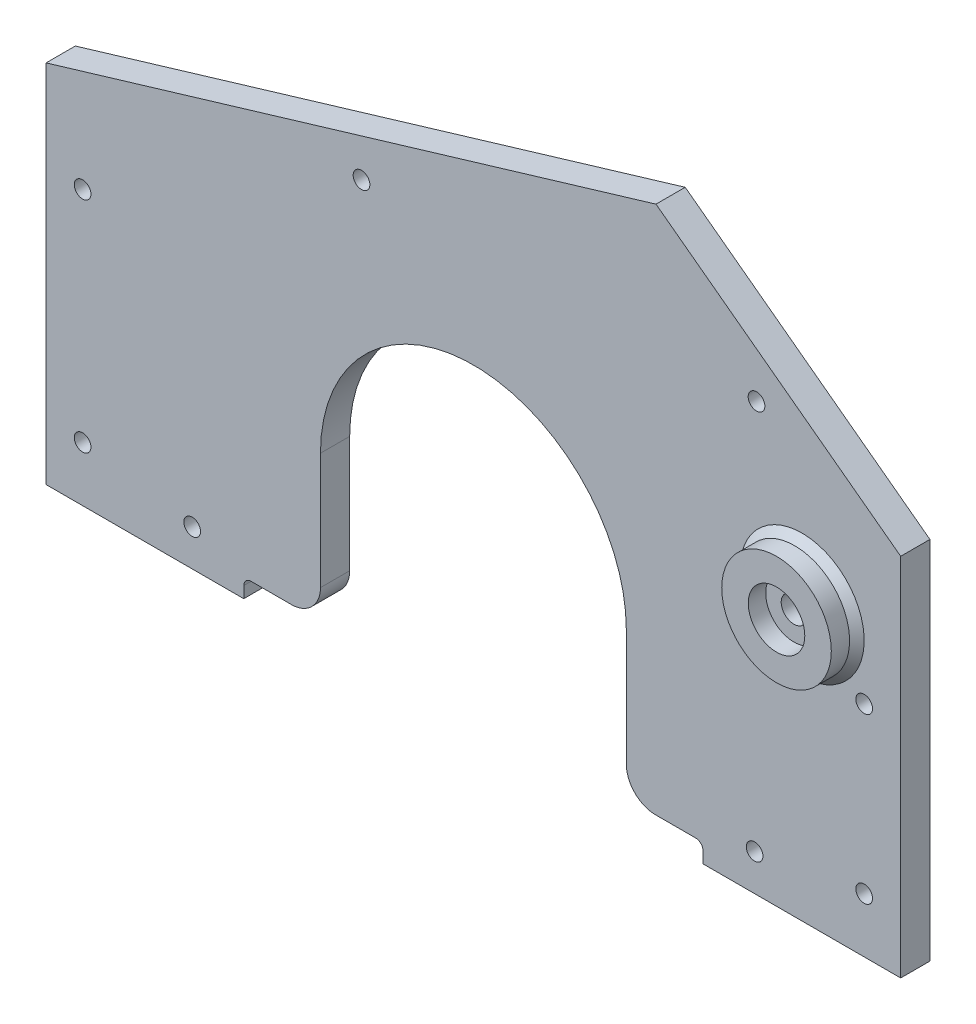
from build123d import *

# Parameters (mm, degrees)
SKETCH1_R               = 2.285
BOSS_EXTRUDE1_DEPTH     = 8
SKETCH2_R               = 15
BOSS_EXTRUDE2_DEPTH     = 15
CUT_EXTRUDE1_DEPTH      = 18
CUT_EXTRUDE1_DEPTH_BACK = 2
SKETCH3_R               = 3.5
CUT_EXTRUDE2_START      = 10.222
SKETCH4_R               = 7.7375
CUT_EXTRUDE2_DEPTH      = 6
FILLET1_R               = 8
FILLET2_R               = 2
CHAMFER1_SIZE           = 2


with BuildPart() as part:
    # Sketch1 → Boss-Extrude1 (new body)
    with BuildSketch(Plane.XY):
        Polygon((-135.206606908, -69.673474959), (-135.206606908, 30.326525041), (31.793393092, 80.326525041), (98.793393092, 30.326525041), (98.793393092, -69.673474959), align=None)
        with Locations((-125.206606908, 5.326525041)):
            Circle(SKETCH1_R, mode=Mode.SUBTRACT)
        with Locations((-95.206606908, -59.673474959)):
            Circle(SKETCH1_R, mode=Mode.SUBTRACT)
        with Locations((59.312548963, 47.312193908)):
            Circle(SKETCH1_R, mode=Mode.SUBTRACT)
        with Locations((-48.838391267, 45.7466848)):
            Circle(SKETCH1_R, mode=Mode.SUBTRACT)
        with Locations(Location((58.793393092, -59.673474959, 0), (0, 0, 180))):
            Circle(SKETCH1_R, mode=Mode.SUBTRACT)
        with Locations(Location((-125.206606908, -54.673474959, 0), (0, 0, 180))):
            Circle(SKETCH1_R, mode=Mode.SUBTRACT)
        with Locations((88.793393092, -54.673474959)):
            Circle(SKETCH1_R, mode=Mode.SUBTRACT)
        with Locations((88.793393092, -9.673474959)):
            Circle(SKETCH1_R, mode=Mode.SUBTRACT)
    extrude(amount=BOSS_EXTRUDE1_DEPTH)

    # Sketch2 → Boss-Extrude2 (add)
    with BuildSketch(Plane.XY):
        with Locations(Location((71.793393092, 5.326525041, 0), (0, 0, 180))):
            Circle(SKETCH2_R)
    extrude(amount=BOSS_EXTRUDE2_DEPTH)

    # Sketch3 → Cut-Extrude1 (cut, two sides: drawn at the far end of the back side and taken through both)
    with BuildSketch(Plane.XY.offset(-CUT_EXTRUDE1_DEPTH_BACK)):
        with Locations((71.793393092, 5.326525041)):
            Circle(SKETCH3_R)
        with BuildLine():
            Line((44.668393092, -69.673474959), (44.668393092, -64.543474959))
            Line((44.668393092, -64.543474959), (23.668393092, -64.543474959))
            Line((23.668393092, -64.543474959), (23.668393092, -24.673474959))
            ThreePointArc((23.668393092, -24.673474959), (-18.206606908, 17.201525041), (-60.081606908, -24.673474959))
            Line((-60.081606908, -24.673474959), (-60.081606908, -64.543474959))
            Line((-60.081606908, -64.543474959), (-81.081606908, -64.543474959))
            Line((-81.081606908, -64.543474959), (-81.081606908, -69.673474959))
            Line((-81.081606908, -69.673474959), (-81.081606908, -72.333497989))
            Line((-81.081606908, -72.333497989), (44.668393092, -72.333497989))
            Line((44.668393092, -72.333497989), (44.668393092, -69.673474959))
        make_face()
    extrude(amount=CUT_EXTRUDE1_DEPTH + CUT_EXTRUDE1_DEPTH_BACK, mode=Mode.SUBTRACT)

    # Sketch4 → Cut-Extrude2 (cut)
    with BuildSketch(Plane.XY.offset(CUT_EXTRUDE2_START)):
        with Locations((71.793393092, 5.326525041)):
            Circle(SKETCH4_R)
    extrude(amount=CUT_EXTRUDE2_DEPTH, mode=Mode.SUBTRACT)

    # Fillet1
    fillet1_edges = [part.edges().sort_by_distance(p)[0] for p in [
        (23.668393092, -64.543474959, 4),
        (-60.081606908, -64.543474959, 4),
    ]]
    fillet(fillet1_edges, radius=FILLET1_R)

    # Fillet2
    fillet2_edges = [part.edges().sort_by_distance(p)[0] for p in [
        (-81.081606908, -64.543474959, 4),
        (44.668393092, -64.543474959, 4),
    ]]
    fillet(fillet2_edges, radius=FILLET2_R)

    # Chamfer1
    chamfer1_edges = [part.edges().sort_by_distance(p)[0] for p in [
        (86.793393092, 5.326525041, 8),
    ]]
    chamfer(chamfer1_edges, length=CHAMFER1_SIZE)


solid = part.part
